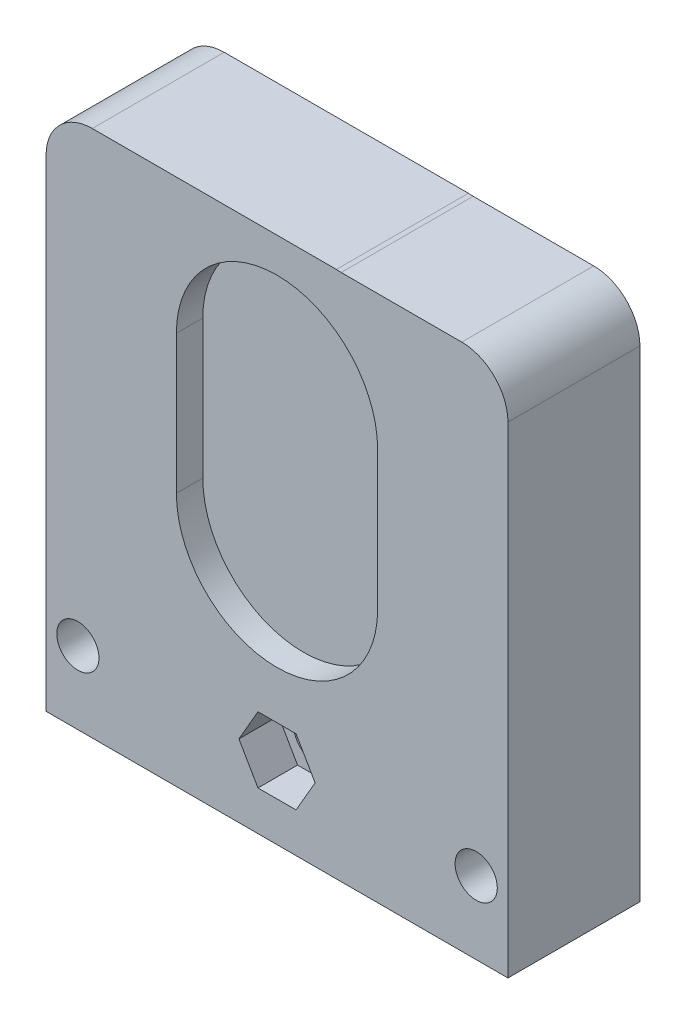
ISO-10303-21;
HEADER;
FILE_DESCRIPTION(('STEP AP214'),'2;1');
FILE_NAME('part.step','',(''),(''),'','','');
FILE_SCHEMA(('AUTOMOTIVE_DESIGN { 1 0 10303 214 1 1 1 1 }'));
ENDSEC;
DATA;
#1=APPLICATION_CONTEXT('core data for automotive mechanical design processes');
#2=APPLICATION_PROTOCOL_DEFINITION('international standard','automotive_design',2000,#1);
#3=PRODUCT_CONTEXT('',#1,'mechanical');
#4=PRODUCT('Part','Part','',(#3));
#5=PRODUCT_RELATED_PRODUCT_CATEGORY('part','',(#4));
#6=PRODUCT_DEFINITION_FORMATION('','',#4);
#7=PRODUCT_DEFINITION_CONTEXT('part definition',#1,'design');
#8=PRODUCT_DEFINITION('design','',#6,#7);
#9=PRODUCT_DEFINITION_SHAPE('','',#8);
#10=(LENGTH_UNIT() NAMED_UNIT(*) SI_UNIT(.MILLI.,.METRE.));
#11=(NAMED_UNIT(*) PLANE_ANGLE_UNIT() SI_UNIT($,.RADIAN.));
#12=(NAMED_UNIT(*) SI_UNIT($,.STERADIAN.) SOLID_ANGLE_UNIT());
#13=UNCERTAINTY_MEASURE_WITH_UNIT(LENGTH_MEASURE(1.E-05),#10,'distance_accuracy_value','');
#14=(GEOMETRIC_REPRESENTATION_CONTEXT(3) GLOBAL_UNCERTAINTY_ASSIGNED_CONTEXT((#13)) GLOBAL_UNIT_ASSIGNED_CONTEXT((#10,
#11,#12)) REPRESENTATION_CONTEXT('',''));
#15=CARTESIAN_POINT('',(0.,0.,0.));
#16=DIRECTION('',(0.,0.,1.));
#17=DIRECTION('',(1.,0.,0.));
#18=AXIS2_PLACEMENT_3D('',#15,#16,#17);
#19=CARTESIAN_POINT('',(35.,11.,0.));
#20=DIRECTION('',(0.,0.,1.));
#21=DIRECTION('',(1.,0.,0.));
#22=AXIS2_PLACEMENT_3D('',#19,#20,#21);
#23=CYLINDRICAL_SURFACE('',#22,3.5);
#24=CARTESIAN_POINT('',(35.,11.,0.));
#25=DIRECTION('',(0.,0.,1.));
#26=DIRECTION('',(1.,0.,0.));
#27=AXIS2_PLACEMENT_3D('',#24,#25,#26);
#28=CIRCLE('',#27,3.5);
#29=CARTESIAN_POINT('',(38.5,11.,0.));
#30=VERTEX_POINT('',#29);
#31=EDGE_CURVE('E277',#30,#30,#28,.T.);
#32=ORIENTED_EDGE('',*,*,#31,.F.);
#33=EDGE_LOOP('',(#32));
#34=FACE_BOUND('',#33,.T.);
#35=CARTESIAN_POINT('',(35.,11.,14.));
#36=DIRECTION('',(0.,0.,1.));
#37=DIRECTION('',(1.,0.,0.));
#38=AXIS2_PLACEMENT_3D('',#35,#36,#37);
#39=CIRCLE('',#38,3.5);
#40=CARTESIAN_POINT('',(38.5,11.,14.));
#41=VERTEX_POINT('',#40);
#42=EDGE_CURVE('E230',#41,#41,#39,.F.);
#43=ORIENTED_EDGE('',*,*,#42,.F.);
#44=EDGE_LOOP('',(#43));
#45=FACE_BOUND('',#44,.T.);
#46=ADVANCED_FACE('F39',(#34,#45),#23,.F.);
#47=CARTESIAN_POINT('',(44.,80.,20.));
#48=DIRECTION('',(-0.0545219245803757,-0.998512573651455,0.));
#49=DIRECTION('',(0.998512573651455,-0.0545219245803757,0.));
#50=AXIS2_PLACEMENT_3D('',#47,#48,#49);
#51=PLANE('',#50);
#52=DIRECTION('',(-0.998512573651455,0.0545219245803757,0.));
#53=VECTOR('',#52,1.);
#54=CARTESIAN_POINT('',(44.,80.,0.));
#55=LINE('',#54,#53);
#56=CARTESIAN_POINT('',(44.7245220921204,79.9604388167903,0.));
#57=VERTEX_POINT('',#56);
#58=CARTESIAN_POINT('',(44.,80.,0.));
#59=VERTEX_POINT('',#58);
#60=EDGE_CURVE('E303',#57,#59,#55,.T.);
#61=ORIENTED_EDGE('',*,*,#60,.T.);
#62=DIRECTION('',(0.,0.,-1.));
#63=VECTOR('',#62,1.);
#64=CARTESIAN_POINT('',(44.,80.,20.));
#65=LINE('',#64,#63);
#66=CARTESIAN_POINT('',(44.,80.,20.));
#67=VERTEX_POINT('',#66);
#68=EDGE_CURVE('E359',#67,#59,#65,.T.);
#69=ORIENTED_EDGE('',*,*,#68,.F.);
#70=DIRECTION('',(-0.998512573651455,0.0545219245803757,0.));
#71=VECTOR('',#70,1.);
#72=CARTESIAN_POINT('',(44.,80.,20.));
#73=LINE('',#72,#71);
#74=CARTESIAN_POINT('',(44.7245220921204,79.9604388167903,20.));
#75=VERTEX_POINT('',#74);
#76=EDGE_CURVE('E307',#75,#67,#73,.T.);
#77=ORIENTED_EDGE('',*,*,#76,.F.);
#78=DIRECTION('',(0.,0.,-1.));
#79=VECTOR('',#78,1.);
#80=CARTESIAN_POINT('',(44.7245220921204,79.9604388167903,20.));
#81=LINE('',#80,#79);
#82=EDGE_CURVE('E328',#75,#57,#81,.T.);
#83=ORIENTED_EDGE('',*,*,#82,.T.);
#84=EDGE_LOOP('',(#61,#69,#77,#83));
#85=FACE_BOUND('',#84,.T.);
#86=ADVANCED_FACE('F396',(#85),#51,.F.);
#87=CARTESIAN_POINT('',(0.,80.,20.));
#88=DIRECTION('',(0.,-1.,0.));
#89=DIRECTION('',(0.,0.,-1.));
#90=AXIS2_PLACEMENT_3D('',#87,#88,#89);
#91=PLANE('',#90);
#92=DIRECTION('',(-1.,0.,0.));
#93=VECTOR('',#92,1.);
#94=CARTESIAN_POINT('',(0.,80.,0.));
#95=LINE('',#94,#93);
#96=CARTESIAN_POINT('',(7.00000000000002,80.,0.));
#97=VERTEX_POINT('',#96);
#98=EDGE_CURVE('E332',#59,#97,#95,.T.);
#99=ORIENTED_EDGE('',*,*,#98,.T.);
#100=DIRECTION('',(0.,0.,-1.));
#101=VECTOR('',#100,1.);
#102=CARTESIAN_POINT('',(7.00000000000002,80.,20.));
#103=LINE('',#102,#101);
#104=CARTESIAN_POINT('',(7.00000000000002,80.,20.));
#105=VERTEX_POINT('',#104);
#106=EDGE_CURVE('E370',#97,#105,#103,.F.);
#107=ORIENTED_EDGE('',*,*,#106,.T.);
#108=DIRECTION('',(-1.,0.,0.));
#109=VECTOR('',#108,1.);
#110=CARTESIAN_POINT('',(26.,80.,20.));
#111=LINE('',#110,#109);
#112=EDGE_CURVE('E311',#67,#105,#111,.T.);
#113=ORIENTED_EDGE('',*,*,#112,.F.);
#114=ORIENTED_EDGE('',*,*,#68,.T.);
#115=EDGE_LOOP('',(#99,#107,#113,#114));
#116=FACE_BOUND('',#115,.T.);
#117=ADVANCED_FACE('F413',(#116),#91,.F.);
#118=CARTESIAN_POINT('',(0.,18.,20.));
#119=DIRECTION('',(1.,0.,0.));
#120=DIRECTION('',(0.,1.,0.));
#121=AXIS2_PLACEMENT_3D('',#118,#119,#120);
#122=PLANE('',#121);
#123=DIRECTION('',(0.,-1.,0.));
#124=VECTOR('',#123,1.);
#125=CARTESIAN_POINT('',(0.,18.,20.));
#126=LINE('',#125,#124);
#127=CARTESIAN_POINT('',(0.,73.,20.));
#128=VERTEX_POINT('',#127);
#129=CARTESIAN_POINT('',(0.,0.,20.));
#130=VERTEX_POINT('',#129);
#131=EDGE_CURVE('E316',#128,#130,#126,.T.);
#132=ORIENTED_EDGE('',*,*,#131,.F.);
#133=DIRECTION('',(0.,0.,-1.));
#134=VECTOR('',#133,1.);
#135=CARTESIAN_POINT('',(0.,73.,20.));
#136=LINE('',#135,#134);
#137=CARTESIAN_POINT('',(0.,73.,0.));
#138=VERTEX_POINT('',#137);
#139=EDGE_CURVE('E363',#128,#138,#136,.T.);
#140=ORIENTED_EDGE('',*,*,#139,.T.);
#141=DIRECTION('',(0.,-1.,0.));
#142=VECTOR('',#141,1.);
#143=CARTESIAN_POINT('',(0.,18.,0.));
#144=LINE('',#143,#142);
#145=CARTESIAN_POINT('',(0.,0.,0.));
#146=VERTEX_POINT('',#145);
#147=EDGE_CURVE('E336',#138,#146,#144,.T.);
#148=ORIENTED_EDGE('',*,*,#147,.T.);
#149=DIRECTION('',(0.,0.,-1.));
#150=VECTOR('',#149,1.);
#151=CARTESIAN_POINT('',(0.,0.,20.));
#152=LINE('',#151,#150);
#153=EDGE_CURVE('E355',#130,#146,#152,.T.);
#154=ORIENTED_EDGE('',*,*,#153,.F.);
#155=EDGE_LOOP('',(#132,#140,#148,#154));
#156=FACE_BOUND('',#155,.T.);
#157=ADVANCED_FACE('F440',(#156),#122,.F.);
#158=CARTESIAN_POINT('',(0.,0.,20.));
#159=DIRECTION('',(0.,1.,0.));
#160=DIRECTION('',(0.,0.,1.));
#161=AXIS2_PLACEMENT_3D('',#158,#159,#160);
#162=PLANE('',#161);
#163=DIRECTION('',(1.,0.,0.));
#164=VECTOR('',#163,1.);
#165=CARTESIAN_POINT('',(0.,0.,0.));
#166=LINE('',#165,#164);
#167=CARTESIAN_POINT('',(70.,0.,0.));
#168=VERTEX_POINT('',#167);
#169=EDGE_CURVE('E339',#146,#168,#166,.T.);
#170=ORIENTED_EDGE('',*,*,#169,.T.);
#171=DIRECTION('',(0.,0.,-1.));
#172=VECTOR('',#171,1.);
#173=CARTESIAN_POINT('',(70.,0.,20.));
#174=LINE('',#173,#172);
#175=CARTESIAN_POINT('',(70.,0.,20.));
#176=VERTEX_POINT('',#175);
#177=EDGE_CURVE('E351',#176,#168,#174,.T.);
#178=ORIENTED_EDGE('',*,*,#177,.F.);
#179=DIRECTION('',(1.,0.,0.));
#180=VECTOR('',#179,1.);
#181=CARTESIAN_POINT('',(0.,0.,20.));
#182=LINE('',#181,#180);
#183=EDGE_CURVE('E319',#130,#176,#182,.T.);
#184=ORIENTED_EDGE('',*,*,#183,.F.);
#185=ORIENTED_EDGE('',*,*,#153,.T.);
#186=EDGE_LOOP('',(#170,#178,#184,#185));
#187=FACE_BOUND('',#186,.T.);
#188=ADVANCED_FACE('F437',(#187),#162,.F.);
#189=CARTESIAN_POINT('',(70.,18.,20.));
#190=DIRECTION('',(-1.,0.,0.));
#191=DIRECTION('',(0.,0.,1.));
#192=AXIS2_PLACEMENT_3D('',#189,#190,#191);
#193=PLANE('',#192);
#194=DIRECTION('',(0.,1.,0.));
#195=VECTOR('',#194,1.);
#196=CARTESIAN_POINT('',(70.,18.,0.));
#197=LINE('',#196,#195);
#198=CARTESIAN_POINT('',(70.,72.9604388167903,0.));
#199=VERTEX_POINT('',#198);
#200=EDGE_CURVE('E343',#168,#199,#197,.T.);
#201=ORIENTED_EDGE('',*,*,#200,.T.);
#202=DIRECTION('',(0.,0.,-1.));
#203=VECTOR('',#202,1.);
#204=CARTESIAN_POINT('',(70.,72.9604388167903,20.));
#205=LINE('',#204,#203);
#206=CARTESIAN_POINT('',(70.,72.9604388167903,20.));
#207=VERTEX_POINT('',#206);
#208=EDGE_CURVE('E48',#199,#207,#205,.F.);
#209=ORIENTED_EDGE('',*,*,#208,.T.);
#210=DIRECTION('',(0.,1.,0.));
#211=VECTOR('',#210,1.);
#212=CARTESIAN_POINT('',(70.,18.,20.));
#213=LINE('',#212,#211);
#214=EDGE_CURVE('E322',#176,#207,#213,.T.);
#215=ORIENTED_EDGE('',*,*,#214,.F.);
#216=ORIENTED_EDGE('',*,*,#177,.T.);
#217=EDGE_LOOP('',(#201,#209,#215,#216));
#218=FACE_BOUND('',#217,.T.);
#219=ADVANCED_FACE('F434',(#218),#193,.F.);
#220=CARTESIAN_POINT('',(70.,79.9604388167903,20.));
#221=DIRECTION('',(0.,-1.,0.));
#222=DIRECTION('',(0.,0.,-1.));
#223=AXIS2_PLACEMENT_3D('',#220,#221,#222);
#224=PLANE('',#223);
#225=DIRECTION('',(-1.,0.,0.));
#226=VECTOR('',#225,1.);
#227=CARTESIAN_POINT('',(70.,79.9604388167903,20.));
#228=LINE('',#227,#226);
#229=CARTESIAN_POINT('',(63.,79.9604388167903,20.));
#230=VERTEX_POINT('',#229);
#231=EDGE_CURVE('E325',#230,#75,#228,.T.);
#232=ORIENTED_EDGE('',*,*,#231,.F.);
#233=DIRECTION('',(0.,0.,-1.));
#234=VECTOR('',#233,1.);
#235=CARTESIAN_POINT('',(63.,79.9604388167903,20.));
#236=LINE('',#235,#234);
#237=CARTESIAN_POINT('',(63.,79.9604388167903,0.));
#238=VERTEX_POINT('',#237);
#239=EDGE_CURVE('E376',#230,#238,#236,.T.);
#240=ORIENTED_EDGE('',*,*,#239,.T.);
#241=DIRECTION('',(-1.,0.,0.));
#242=VECTOR('',#241,1.);
#243=CARTESIAN_POINT('',(70.,79.9604388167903,0.));
#244=LINE('',#243,#242);
#245=EDGE_CURVE('E312',#238,#57,#244,.T.);
#246=ORIENTED_EDGE('',*,*,#245,.T.);
#247=ORIENTED_EDGE('',*,*,#82,.F.);
#248=EDGE_LOOP('',(#232,#240,#246,#247));
#249=FACE_BOUND('',#248,.T.);
#250=ADVANCED_FACE('F388',(#249),#224,.F.);
#251=CARTESIAN_POINT('',(0.,0.,20.));
#252=DIRECTION('',(0.,0.,1.));
#253=DIRECTION('',(1.,0.,0.));
#254=AXIS2_PLACEMENT_3D('',#251,#252,#253);
#255=PLANE('',#254);
#256=DIRECTION('',(0.5,0.866025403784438,0.));
#257=VECTOR('',#256,1.);
#258=CARTESIAN_POINT('',(37.8867513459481,6.00000000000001,20.));
#259=LINE('',#258,#257);
#260=CARTESIAN_POINT('',(37.8867513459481,6.00000000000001,20.));
#261=VERTEX_POINT('',#260);
#262=CARTESIAN_POINT('',(40.7735026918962,11.,20.));
#263=VERTEX_POINT('',#262);
#264=EDGE_CURVE('E171',#261,#263,#259,.T.);
#265=ORIENTED_EDGE('',*,*,#264,.F.);
#266=DIRECTION('',(1.,0.,0.));
#267=VECTOR('',#266,1.);
#268=CARTESIAN_POINT('',(32.1132486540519,6.,20.));
#269=LINE('',#268,#267);
#270=CARTESIAN_POINT('',(32.1132486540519,6.,20.));
#271=VERTEX_POINT('',#270);
#272=EDGE_CURVE('E193',#271,#261,#269,.T.);
#273=ORIENTED_EDGE('',*,*,#272,.F.);
#274=DIRECTION('',(0.5,-0.866025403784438,0.));
#275=VECTOR('',#274,1.);
#276=CARTESIAN_POINT('',(29.2264973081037,11.,20.));
#277=LINE('',#276,#275);
#278=CARTESIAN_POINT('',(29.2264973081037,11.,20.));
#279=VERTEX_POINT('',#278);
#280=EDGE_CURVE('E197',#279,#271,#277,.T.);
#281=ORIENTED_EDGE('',*,*,#280,.F.);
#282=DIRECTION('',(-0.5,-0.866025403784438,0.));
#283=VECTOR('',#282,1.);
#284=CARTESIAN_POINT('',(32.1132486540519,16.,20.));
#285=LINE('',#284,#283);
#286=CARTESIAN_POINT('',(32.1132486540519,16.,20.));
#287=VERTEX_POINT('',#286);
#288=EDGE_CURVE('E220',#287,#279,#285,.T.);
#289=ORIENTED_EDGE('',*,*,#288,.F.);
#290=DIRECTION('',(-1.,0.,0.));
#291=VECTOR('',#290,1.);
#292=CARTESIAN_POINT('',(37.8867513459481,16.,20.));
#293=LINE('',#292,#291);
#294=CARTESIAN_POINT('',(37.8867513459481,16.,20.));
#295=VERTEX_POINT('',#294);
#296=EDGE_CURVE('E216',#295,#287,#293,.T.);
#297=ORIENTED_EDGE('',*,*,#296,.F.);
#298=DIRECTION('',(-0.5,0.866025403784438,0.));
#299=VECTOR('',#298,1.);
#300=CARTESIAN_POINT('',(40.7735026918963,11.,20.));
#301=LINE('',#300,#299);
#302=EDGE_CURVE('E213',#263,#295,#301,.T.);
#303=ORIENTED_EDGE('',*,*,#302,.F.);
#304=EDGE_LOOP('',(#265,#273,#281,#289,#297,#303));
#305=FACE_BOUND('',#304,.T.);
#306=CARTESIAN_POINT('',(35.,59.5,20.));
#307=DIRECTION('',(0.,0.,1.));
#308=DIRECTION('',(1.,0.,0.));
#309=AXIS2_PLACEMENT_3D('',#306,#307,#308);
#310=CIRCLE('',#309,15.25);
#311=CARTESIAN_POINT('',(50.25,59.5,20.));
#312=VERTEX_POINT('',#311);
#313=CARTESIAN_POINT('',(19.75,59.5,20.));
#314=VERTEX_POINT('',#313);
#315=EDGE_CURVE('E260',#312,#314,#310,.T.);
#316=ORIENTED_EDGE('',*,*,#315,.F.);
#317=DIRECTION('',(0.,1.,0.));
#318=VECTOR('',#317,1.);
#319=CARTESIAN_POINT('',(50.25,59.5,20.));
#320=LINE('',#319,#318);
#321=CARTESIAN_POINT('',(50.25,38.5,20.));
#322=VERTEX_POINT('',#321);
#323=EDGE_CURVE('E247',#322,#312,#320,.T.);
#324=ORIENTED_EDGE('',*,*,#323,.F.);
#325=CARTESIAN_POINT('',(35.,38.5,20.));
#326=DIRECTION('',(0.,0.,1.));
#327=DIRECTION('',(1.,0.,0.));
#328=AXIS2_PLACEMENT_3D('',#325,#326,#327);
#329=CIRCLE('',#328,15.25);
#330=CARTESIAN_POINT('',(19.75,38.5,20.));
#331=VERTEX_POINT('',#330);
#332=EDGE_CURVE('E267',#331,#322,#329,.T.);
#333=ORIENTED_EDGE('',*,*,#332,.F.);
#334=DIRECTION('',(0.,-1.,0.));
#335=VECTOR('',#334,1.);
#336=CARTESIAN_POINT('',(19.75,59.5,20.));
#337=LINE('',#336,#335);
#338=EDGE_CURVE('E263',#314,#331,#337,.T.);
#339=ORIENTED_EDGE('',*,*,#338,.F.);
#340=EDGE_LOOP('',(#316,#324,#333,#339));
#341=FACE_BOUND('',#340,.T.);
#342=CARTESIAN_POINT('',(65.185,11.,20.));
#343=DIRECTION('',(0.,0.,1.));
#344=DIRECTION('',(1.,0.,0.));
#345=AXIS2_PLACEMENT_3D('',#342,#343,#344);
#346=CIRCLE('',#345,3.2);
#347=CARTESIAN_POINT('',(68.385,11.,20.));
#348=VERTEX_POINT('',#347);
#349=EDGE_CURVE('E292',#348,#348,#346,.T.);
#350=ORIENTED_EDGE('',*,*,#349,.F.);
#351=EDGE_LOOP('',(#350));
#352=FACE_BOUND('',#351,.T.);
#353=CARTESIAN_POINT('',(4.815,11.,20.));
#354=DIRECTION('',(0.,0.,1.));
#355=DIRECTION('',(1.,0.,0.));
#356=AXIS2_PLACEMENT_3D('',#353,#354,#355);
#357=CIRCLE('',#356,3.2);
#358=CARTESIAN_POINT('',(8.015,11.,20.));
#359=VERTEX_POINT('',#358);
#360=EDGE_CURVE('E291',#359,#359,#357,.T.);
#361=ORIENTED_EDGE('',*,*,#360,.F.);
#362=EDGE_LOOP('',(#361));
#363=FACE_BOUND('',#362,.T.);
#364=ORIENTED_EDGE('',*,*,#214,.T.);
#365=CARTESIAN_POINT('',(63.,72.9604388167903,20.));
#366=DIRECTION('',(0.,0.,1.));
#367=DIRECTION('',(1.,0.,0.));
#368=AXIS2_PLACEMENT_3D('',#365,#366,#367);
#369=CIRCLE('',#368,7.);
#370=EDGE_CURVE('E11',#207,#230,#369,.T.);
#371=ORIENTED_EDGE('',*,*,#370,.T.);
#372=ORIENTED_EDGE('',*,*,#231,.T.);
#373=ORIENTED_EDGE('',*,*,#76,.T.);
#374=ORIENTED_EDGE('',*,*,#112,.T.);
#375=CARTESIAN_POINT('',(7.00000000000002,73.,20.));
#376=DIRECTION('',(0.,0.,1.));
#377=DIRECTION('',(1.,0.,0.));
#378=AXIS2_PLACEMENT_3D('',#375,#376,#377);
#379=CIRCLE('',#378,7.);
#380=EDGE_CURVE('E373',#105,#128,#379,.T.);
#381=ORIENTED_EDGE('',*,*,#380,.T.);
#382=ORIENTED_EDGE('',*,*,#131,.T.);
#383=ORIENTED_EDGE('',*,*,#183,.T.);
#384=EDGE_LOOP('',(#364,#371,#372,#373,#374,#381,#382,#383));
#385=FACE_BOUND('',#384,.T.);
#386=ADVANCED_FACE('F399',(#305,#341,#352,#363,#385),#255,.T.);
#387=CARTESIAN_POINT('',(0.,0.,0.));
#388=DIRECTION('',(0.,0.,1.));
#389=DIRECTION('',(1.,0.,0.));
#390=AXIS2_PLACEMENT_3D('',#387,#388,#389);
#391=PLANE('',#390);
#392=CARTESIAN_POINT('',(65.185,11.,0.));
#393=DIRECTION('',(0.,0.,1.));
#394=DIRECTION('',(1.,0.,0.));
#395=AXIS2_PLACEMENT_3D('',#392,#393,#394);
#396=CIRCLE('',#395,3.2);
#397=CARTESIAN_POINT('',(68.385,11.,0.));
#398=VERTEX_POINT('',#397);
#399=EDGE_CURVE('E287',#398,#398,#396,.T.);
#400=ORIENTED_EDGE('',*,*,#399,.T.);
#401=EDGE_LOOP('',(#400));
#402=FACE_BOUND('',#401,.T.);
#403=ORIENTED_EDGE('',*,*,#31,.T.);
#404=EDGE_LOOP('',(#403));
#405=FACE_BOUND('',#404,.T.);
#406=CARTESIAN_POINT('',(4.815,11.,0.));
#407=DIRECTION('',(0.,0.,1.));
#408=DIRECTION('',(1.,0.,0.));
#409=AXIS2_PLACEMENT_3D('',#406,#407,#408);
#410=CIRCLE('',#409,3.2);
#411=CARTESIAN_POINT('',(8.015,11.,0.));
#412=VERTEX_POINT('',#411);
#413=EDGE_CURVE('E299',#412,#412,#410,.T.);
#414=ORIENTED_EDGE('',*,*,#413,.T.);
#415=EDGE_LOOP('',(#414));
#416=FACE_BOUND('',#415,.T.);
#417=ORIENTED_EDGE('',*,*,#245,.F.);
#418=CARTESIAN_POINT('',(63.,72.9604388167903,0.));
#419=DIRECTION('',(0.,0.,1.));
#420=DIRECTION('',(1.,0.,0.));
#421=AXIS2_PLACEMENT_3D('',#418,#419,#420);
#422=CIRCLE('',#421,7.);
#423=EDGE_CURVE('E62',#238,#199,#422,.F.);
#424=ORIENTED_EDGE('',*,*,#423,.T.);
#425=ORIENTED_EDGE('',*,*,#200,.F.);
#426=ORIENTED_EDGE('',*,*,#169,.F.);
#427=ORIENTED_EDGE('',*,*,#147,.F.);
#428=CARTESIAN_POINT('',(7.00000000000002,73.,0.));
#429=DIRECTION('',(0.,0.,1.));
#430=DIRECTION('',(1.,0.,0.));
#431=AXIS2_PLACEMENT_3D('',#428,#429,#430);
#432=CIRCLE('',#431,7.);
#433=EDGE_CURVE('E367',#138,#97,#432,.F.);
#434=ORIENTED_EDGE('',*,*,#433,.T.);
#435=ORIENTED_EDGE('',*,*,#98,.F.);
#436=ORIENTED_EDGE('',*,*,#60,.F.);
#437=EDGE_LOOP('',(#417,#424,#425,#426,#427,#434,#435,#436));
#438=FACE_BOUND('',#437,.T.);
#439=ADVANCED_FACE('F393',(#402,#405,#416,#438),#391,.F.);
#440=CARTESIAN_POINT('',(7.00000000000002,73.,20.));
#441=DIRECTION('',(0.,0.,-1.));
#442=DIRECTION('',(-1.,0.,0.));
#443=AXIS2_PLACEMENT_3D('',#440,#441,#442);
#444=CYLINDRICAL_SURFACE('',#443,7.);
#445=ORIENTED_EDGE('',*,*,#380,.F.);
#446=ORIENTED_EDGE('',*,*,#106,.F.);
#447=ORIENTED_EDGE('',*,*,#433,.F.);
#448=ORIENTED_EDGE('',*,*,#139,.F.);
#449=EDGE_LOOP('',(#445,#446,#447,#448));
#450=FACE_BOUND('',#449,.T.);
#451=ADVANCED_FACE('F424',(#450),#444,.T.);
#452=CARTESIAN_POINT('',(4.815,11.,0.));
#453=DIRECTION('',(0.,0.,1.));
#454=DIRECTION('',(1.,0.,0.));
#455=AXIS2_PLACEMENT_3D('',#452,#453,#454);
#456=CYLINDRICAL_SURFACE('',#455,3.2);
#457=ORIENTED_EDGE('',*,*,#413,.F.);
#458=EDGE_LOOP('',(#457));
#459=FACE_BOUND('',#458,.T.);
#460=ORIENTED_EDGE('',*,*,#360,.T.);
#461=EDGE_LOOP('',(#460));
#462=FACE_BOUND('',#461,.T.);
#463=ADVANCED_FACE('F421',(#459,#462),#456,.F.);
#464=CARTESIAN_POINT('',(65.185,11.,0.));
#465=DIRECTION('',(0.,0.,1.));
#466=DIRECTION('',(1.,0.,0.));
#467=AXIS2_PLACEMENT_3D('',#464,#465,#466);
#468=CYLINDRICAL_SURFACE('',#467,3.2);
#469=ORIENTED_EDGE('',*,*,#399,.F.);
#470=EDGE_LOOP('',(#469));
#471=FACE_BOUND('',#470,.T.);
#472=ORIENTED_EDGE('',*,*,#349,.T.);
#473=EDGE_LOOP('',(#472));
#474=FACE_BOUND('',#473,.T.);
#475=ADVANCED_FACE('F419',(#471,#474),#468,.F.);
#476=CARTESIAN_POINT('',(35.,59.5,16.));
#477=DIRECTION('',(0.,0.,1.));
#478=DIRECTION('',(1.,0.,0.));
#479=AXIS2_PLACEMENT_3D('',#476,#477,#478);
#480=CYLINDRICAL_SURFACE('',#479,15.25);
#481=ORIENTED_EDGE('',*,*,#315,.T.);
#482=DIRECTION('',(0.,0.,1.));
#483=VECTOR('',#482,1.);
#484=CARTESIAN_POINT('',(19.75,59.5,16.));
#485=LINE('',#484,#483);
#486=CARTESIAN_POINT('',(19.75,59.5,16.));
#487=VERTEX_POINT('',#486);
#488=EDGE_CURVE('E259',#487,#314,#485,.T.);
#489=ORIENTED_EDGE('',*,*,#488,.F.);
#490=CARTESIAN_POINT('',(35.,59.5,16.));
#491=DIRECTION('',(0.,0.,1.));
#492=DIRECTION('',(1.,0.,0.));
#493=AXIS2_PLACEMENT_3D('',#490,#491,#492);
#494=CIRCLE('',#493,15.25);
#495=CARTESIAN_POINT('',(50.25,59.5,16.));
#496=VERTEX_POINT('',#495);
#497=EDGE_CURVE('E242',#496,#487,#494,.T.);
#498=ORIENTED_EDGE('',*,*,#497,.F.);
#499=DIRECTION('',(0.,0.,1.));
#500=VECTOR('',#499,1.);
#501=CARTESIAN_POINT('',(50.25,59.5,16.));
#502=LINE('',#501,#500);
#503=EDGE_CURVE('E274',#496,#312,#502,.T.);
#504=ORIENTED_EDGE('',*,*,#503,.T.);
#505=EDGE_LOOP('',(#481,#489,#498,#504));
#506=FACE_BOUND('',#505,.T.);
#507=ADVANCED_FACE('F472',(#506),#480,.F.);
#508=CARTESIAN_POINT('',(50.25,59.5,16.));
#509=DIRECTION('',(1.,0.,0.));
#510=DIRECTION('',(0.,0.,-1.));
#511=AXIS2_PLACEMENT_3D('',#508,#509,#510);
#512=PLANE('',#511);
#513=ORIENTED_EDGE('',*,*,#323,.T.);
#514=ORIENTED_EDGE('',*,*,#503,.F.);
#515=DIRECTION('',(0.,1.,0.));
#516=VECTOR('',#515,1.);
#517=CARTESIAN_POINT('',(50.25,59.5,16.));
#518=LINE('',#517,#516);
#519=CARTESIAN_POINT('',(50.25,38.5,16.));
#520=VERTEX_POINT('',#519);
#521=EDGE_CURVE('E255',#520,#496,#518,.T.);
#522=ORIENTED_EDGE('',*,*,#521,.F.);
#523=DIRECTION('',(0.,0.,1.));
#524=VECTOR('',#523,1.);
#525=CARTESIAN_POINT('',(50.25,38.5,16.));
#526=LINE('',#525,#524);
#527=EDGE_CURVE('E278',#520,#322,#526,.T.);
#528=ORIENTED_EDGE('',*,*,#527,.T.);
#529=EDGE_LOOP('',(#513,#514,#522,#528));
#530=FACE_BOUND('',#529,.T.);
#531=ADVANCED_FACE('F479',(#530),#512,.F.);
#532=CARTESIAN_POINT('',(35.,38.5,16.));
#533=DIRECTION('',(0.,0.,1.));
#534=DIRECTION('',(1.,0.,0.));
#535=AXIS2_PLACEMENT_3D('',#532,#533,#534);
#536=CYLINDRICAL_SURFACE('',#535,15.25);
#537=ORIENTED_EDGE('',*,*,#332,.T.);
#538=ORIENTED_EDGE('',*,*,#527,.F.);
#539=CARTESIAN_POINT('',(35.,38.5,16.));
#540=DIRECTION('',(0.,0.,1.));
#541=DIRECTION('',(1.,0.,0.));
#542=AXIS2_PLACEMENT_3D('',#539,#540,#541);
#543=CIRCLE('',#542,15.25);
#544=CARTESIAN_POINT('',(19.75,38.5,16.));
#545=VERTEX_POINT('',#544);
#546=EDGE_CURVE('E251',#545,#520,#543,.T.);
#547=ORIENTED_EDGE('',*,*,#546,.F.);
#548=DIRECTION('',(0.,0.,1.));
#549=VECTOR('',#548,1.);
#550=CARTESIAN_POINT('',(19.75,38.5,16.));
#551=LINE('',#550,#549);
#552=EDGE_CURVE('E281',#545,#331,#551,.T.);
#553=ORIENTED_EDGE('',*,*,#552,.T.);
#554=EDGE_LOOP('',(#537,#538,#547,#553));
#555=FACE_BOUND('',#554,.T.);
#556=ADVANCED_FACE('F486',(#555),#536,.F.);
#557=CARTESIAN_POINT('',(19.75,59.5,16.));
#558=DIRECTION('',(-1.,0.,0.));
#559=DIRECTION('',(0.,-1.,0.));
#560=AXIS2_PLACEMENT_3D('',#557,#558,#559);
#561=PLANE('',#560);
#562=ORIENTED_EDGE('',*,*,#338,.T.);
#563=ORIENTED_EDGE('',*,*,#552,.F.);
#564=DIRECTION('',(0.,-1.,0.));
#565=VECTOR('',#564,1.);
#566=CARTESIAN_POINT('',(19.75,59.5,16.));
#567=LINE('',#566,#565);
#568=EDGE_CURVE('E246',#487,#545,#567,.T.);
#569=ORIENTED_EDGE('',*,*,#568,.F.);
#570=ORIENTED_EDGE('',*,*,#488,.T.);
#571=EDGE_LOOP('',(#562,#563,#569,#570));
#572=FACE_BOUND('',#571,.T.);
#573=ADVANCED_FACE('F494',(#572),#561,.F.);
#574=CARTESIAN_POINT('',(35.,59.5,16.));
#575=DIRECTION('',(0.,0.,1.));
#576=DIRECTION('',(1.,0.,0.));
#577=AXIS2_PLACEMENT_3D('',#574,#575,#576);
#578=PLANE('',#577);
#579=ORIENTED_EDGE('',*,*,#497,.T.);
#580=ORIENTED_EDGE('',*,*,#568,.T.);
#581=ORIENTED_EDGE('',*,*,#546,.T.);
#582=ORIENTED_EDGE('',*,*,#521,.T.);
#583=EDGE_LOOP('',(#579,#580,#581,#582));
#584=FACE_BOUND('',#583,.T.);
#585=ADVANCED_FACE('F502',(#584),#578,.T.);
#586=CARTESIAN_POINT('',(0.,0.,14.));
#587=DIRECTION('',(0.,0.,1.));
#588=DIRECTION('',(1.,0.,0.));
#589=AXIS2_PLACEMENT_3D('',#586,#587,#588);
#590=PLANE('',#589);
#591=DIRECTION('',(0.5,0.866025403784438,0.));
#592=VECTOR('',#591,1.);
#593=CARTESIAN_POINT('',(37.8867513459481,6.00000000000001,14.));
#594=LINE('',#593,#592);
#595=CARTESIAN_POINT('',(37.8867513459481,6.00000000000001,14.));
#596=VERTEX_POINT('',#595);
#597=CARTESIAN_POINT('',(40.7735026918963,11.,14.));
#598=VERTEX_POINT('',#597);
#599=EDGE_CURVE('E168',#596,#598,#594,.T.);
#600=ORIENTED_EDGE('',*,*,#599,.T.);
#601=DIRECTION('',(-0.5,0.866025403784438,0.));
#602=VECTOR('',#601,1.);
#603=CARTESIAN_POINT('',(40.7735026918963,11.,14.));
#604=LINE('',#603,#602);
#605=CARTESIAN_POINT('',(37.8867513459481,16.,14.));
#606=VERTEX_POINT('',#605);
#607=EDGE_CURVE('E180',#598,#606,#604,.T.);
#608=ORIENTED_EDGE('',*,*,#607,.T.);
#609=DIRECTION('',(-1.,0.,0.));
#610=VECTOR('',#609,1.);
#611=CARTESIAN_POINT('',(37.8867513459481,16.,14.));
#612=LINE('',#611,#610);
#613=CARTESIAN_POINT('',(32.1132486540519,16.,14.));
#614=VERTEX_POINT('',#613);
#615=EDGE_CURVE('E186',#606,#614,#612,.T.);
#616=ORIENTED_EDGE('',*,*,#615,.T.);
#617=DIRECTION('',(-0.5,-0.866025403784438,0.));
#618=VECTOR('',#617,1.);
#619=CARTESIAN_POINT('',(32.1132486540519,16.,14.));
#620=LINE('',#619,#618);
#621=CARTESIAN_POINT('',(29.2264973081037,11.,14.));
#622=VERTEX_POINT('',#621);
#623=EDGE_CURVE('E202',#614,#622,#620,.T.);
#624=ORIENTED_EDGE('',*,*,#623,.T.);
#625=DIRECTION('',(0.5,-0.866025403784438,0.));
#626=VECTOR('',#625,1.);
#627=CARTESIAN_POINT('',(29.2264973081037,11.,14.));
#628=LINE('',#627,#626);
#629=CARTESIAN_POINT('',(32.1132486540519,6.,14.));
#630=VERTEX_POINT('',#629);
#631=EDGE_CURVE('E206',#622,#630,#628,.T.);
#632=ORIENTED_EDGE('',*,*,#631,.T.);
#633=DIRECTION('',(1.,0.,0.));
#634=VECTOR('',#633,1.);
#635=CARTESIAN_POINT('',(32.1132486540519,6.,14.));
#636=LINE('',#635,#634);
#637=EDGE_CURVE('E177',#630,#596,#636,.T.);
#638=ORIENTED_EDGE('',*,*,#637,.T.);
#639=EDGE_LOOP('',(#600,#608,#616,#624,#632,#638));
#640=FACE_BOUND('',#639,.T.);
#641=ORIENTED_EDGE('',*,*,#42,.T.);
#642=EDGE_LOOP('',(#641));
#643=FACE_BOUND('',#642,.T.);
#644=ADVANCED_FACE('F188',(#640,#643),#590,.T.);
#645=CARTESIAN_POINT('',(37.8867513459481,6.00000000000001,14.));
#646=DIRECTION('',(0.866025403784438,-0.5,0.));
#647=DIRECTION('',(0.5,0.866025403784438,0.));
#648=AXIS2_PLACEMENT_3D('',#645,#646,#647);
#649=PLANE('',#648);
#650=ORIENTED_EDGE('',*,*,#264,.T.);
#651=DIRECTION('',(0.,0.,1.));
#652=VECTOR('',#651,1.);
#653=CARTESIAN_POINT('',(40.7735026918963,11.,14.));
#654=LINE('',#653,#652);
#655=EDGE_CURVE('E164',#598,#263,#654,.T.);
#656=ORIENTED_EDGE('',*,*,#655,.F.);
#657=ORIENTED_EDGE('',*,*,#599,.F.);
#658=DIRECTION('',(0.,0.,1.));
#659=VECTOR('',#658,1.);
#660=CARTESIAN_POINT('',(37.8867513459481,6.00000000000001,14.));
#661=LINE('',#660,#659);
#662=EDGE_CURVE('E227',#596,#261,#661,.T.);
#663=ORIENTED_EDGE('',*,*,#662,.T.);
#664=EDGE_LOOP('',(#650,#656,#657,#663));
#665=FACE_BOUND('',#664,.T.);
#666=ADVANCED_FACE('F166',(#665),#649,.F.);
#667=CARTESIAN_POINT('',(32.1132486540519,6.,14.));
#668=DIRECTION('',(0.,-1.,0.));
#669=DIRECTION('',(1.,0.,0.));
#670=AXIS2_PLACEMENT_3D('',#667,#668,#669);
#671=PLANE('',#670);
#672=ORIENTED_EDGE('',*,*,#272,.T.);
#673=ORIENTED_EDGE('',*,*,#662,.F.);
#674=ORIENTED_EDGE('',*,*,#637,.F.);
#675=DIRECTION('',(0.,0.,1.));
#676=VECTOR('',#675,1.);
#677=CARTESIAN_POINT('',(32.1132486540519,6.,14.));
#678=LINE('',#677,#676);
#679=EDGE_CURVE('E231',#630,#271,#678,.T.);
#680=ORIENTED_EDGE('',*,*,#679,.T.);
#681=EDGE_LOOP('',(#672,#673,#674,#680));
#682=FACE_BOUND('',#681,.T.);
#683=ADVANCED_FACE('F523',(#682),#671,.F.);
#684=CARTESIAN_POINT('',(29.2264973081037,11.,14.));
#685=DIRECTION('',(-0.866025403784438,-0.5,0.));
#686=DIRECTION('',(0.5,-0.866025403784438,0.));
#687=AXIS2_PLACEMENT_3D('',#684,#685,#686);
#688=PLANE('',#687);
#689=ORIENTED_EDGE('',*,*,#280,.T.);
#690=ORIENTED_EDGE('',*,*,#679,.F.);
#691=ORIENTED_EDGE('',*,*,#631,.F.);
#692=DIRECTION('',(0.,0.,1.));
#693=VECTOR('',#692,1.);
#694=CARTESIAN_POINT('',(29.2264973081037,11.,14.));
#695=LINE('',#694,#693);
#696=EDGE_CURVE('E234',#622,#279,#695,.T.);
#697=ORIENTED_EDGE('',*,*,#696,.T.);
#698=EDGE_LOOP('',(#689,#690,#691,#697));
#699=FACE_BOUND('',#698,.T.);
#700=ADVANCED_FACE('F530',(#699),#688,.F.);
#701=CARTESIAN_POINT('',(32.1132486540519,16.,14.));
#702=DIRECTION('',(-0.866025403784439,0.5,0.));
#703=DIRECTION('',(-0.5,-0.866025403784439,0.));
#704=AXIS2_PLACEMENT_3D('',#701,#702,#703);
#705=PLANE('',#704);
#706=ORIENTED_EDGE('',*,*,#288,.T.);
#707=ORIENTED_EDGE('',*,*,#696,.F.);
#708=ORIENTED_EDGE('',*,*,#623,.F.);
#709=DIRECTION('',(0.,0.,1.));
#710=VECTOR('',#709,1.);
#711=CARTESIAN_POINT('',(32.1132486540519,16.,14.));
#712=LINE('',#711,#710);
#713=EDGE_CURVE('E237',#614,#287,#712,.T.);
#714=ORIENTED_EDGE('',*,*,#713,.T.);
#715=EDGE_LOOP('',(#706,#707,#708,#714));
#716=FACE_BOUND('',#715,.T.);
#717=ADVANCED_FACE('F538',(#716),#705,.F.);
#718=CARTESIAN_POINT('',(37.8867513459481,16.,14.));
#719=DIRECTION('',(0.,1.,0.));
#720=DIRECTION('',(0.,0.,1.));
#721=AXIS2_PLACEMENT_3D('',#718,#719,#720);
#722=PLANE('',#721);
#723=ORIENTED_EDGE('',*,*,#296,.T.);
#724=ORIENTED_EDGE('',*,*,#713,.F.);
#725=ORIENTED_EDGE('',*,*,#615,.F.);
#726=DIRECTION('',(0.,0.,1.));
#727=VECTOR('',#726,1.);
#728=CARTESIAN_POINT('',(37.8867513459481,16.,14.));
#729=LINE('',#728,#727);
#730=EDGE_CURVE('E176',#606,#295,#729,.T.);
#731=ORIENTED_EDGE('',*,*,#730,.T.);
#732=EDGE_LOOP('',(#723,#724,#725,#731));
#733=FACE_BOUND('',#732,.T.);
#734=ADVANCED_FACE('F405',(#733),#722,.F.);
#735=CARTESIAN_POINT('',(40.7735026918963,11.,14.));
#736=DIRECTION('',(0.866025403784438,0.5,0.));
#737=DIRECTION('',(-0.5,0.866025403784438,0.));
#738=AXIS2_PLACEMENT_3D('',#735,#736,#737);
#739=PLANE('',#738);
#740=ORIENTED_EDGE('',*,*,#302,.T.);
#741=ORIENTED_EDGE('',*,*,#730,.F.);
#742=ORIENTED_EDGE('',*,*,#607,.F.);
#743=ORIENTED_EDGE('',*,*,#655,.T.);
#744=EDGE_LOOP('',(#740,#741,#742,#743));
#745=FACE_BOUND('',#744,.T.);
#746=ADVANCED_FACE('F181',(#745),#739,.F.);
#747=CARTESIAN_POINT('',(63.,72.9604388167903,20.));
#748=DIRECTION('',(0.,0.,-1.));
#749=DIRECTION('',(-1.,0.,0.));
#750=AXIS2_PLACEMENT_3D('',#747,#748,#749);
#751=CYLINDRICAL_SURFACE('',#750,7.);
#752=ORIENTED_EDGE('',*,*,#370,.F.);
#753=ORIENTED_EDGE('',*,*,#208,.F.);
#754=ORIENTED_EDGE('',*,*,#423,.F.);
#755=ORIENTED_EDGE('',*,*,#239,.F.);
#756=EDGE_LOOP('',(#752,#753,#754,#755));
#757=FACE_BOUND('',#756,.T.);
#758=ADVANCED_FACE('F41',(#757),#751,.T.);
#759=CLOSED_SHELL('',(#46,#86,#117,#157,#188,#219,#250,#386,#439,#451,#463,#475,#507,#531,#556,
#573,#585,#644,#666,#683,#700,#717,#734,#746,#758));
#760=MANIFOLD_SOLID_BREP('B2',#759);
#761=ADVANCED_BREP_SHAPE_REPRESENTATION('',(#18,#760),#14);
#762=SHAPE_DEFINITION_REPRESENTATION(#9,#761);
ENDSEC;
END-ISO-10303-21;
